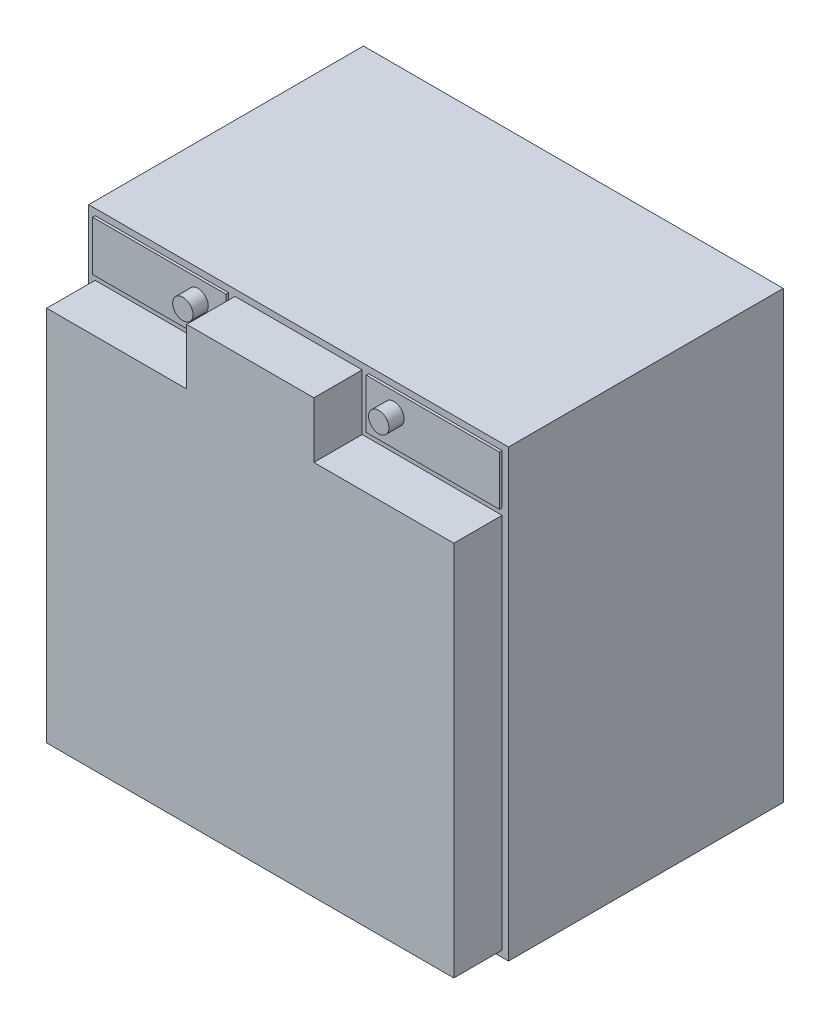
ISO-10303-21;
HEADER;
FILE_DESCRIPTION(('STEP AP214'),'2;1');
FILE_NAME('part.step','',(''),(''),'','','');
FILE_SCHEMA(('AUTOMOTIVE_DESIGN { 1 0 10303 214 1 1 1 1 }'));
ENDSEC;
DATA;
#1=APPLICATION_CONTEXT('core data for automotive mechanical design processes');
#2=APPLICATION_PROTOCOL_DEFINITION('international standard','automotive_design',2000,#1);
#3=PRODUCT_CONTEXT('',#1,'mechanical');
#4=PRODUCT('Part','Part','',(#3));
#5=PRODUCT_RELATED_PRODUCT_CATEGORY('part','',(#4));
#6=PRODUCT_DEFINITION_FORMATION('','',#4);
#7=PRODUCT_DEFINITION_CONTEXT('part definition',#1,'design');
#8=PRODUCT_DEFINITION('design','',#6,#7);
#9=PRODUCT_DEFINITION_SHAPE('','',#8);
#10=(LENGTH_UNIT() NAMED_UNIT(*) SI_UNIT(.MILLI.,.METRE.));
#11=(NAMED_UNIT(*) PLANE_ANGLE_UNIT() SI_UNIT($,.RADIAN.));
#12=(NAMED_UNIT(*) SI_UNIT($,.STERADIAN.) SOLID_ANGLE_UNIT());
#13=UNCERTAINTY_MEASURE_WITH_UNIT(LENGTH_MEASURE(1.E-05),#10,'distance_accuracy_value','');
#14=(GEOMETRIC_REPRESENTATION_CONTEXT(3) GLOBAL_UNCERTAINTY_ASSIGNED_CONTEXT((#13)) GLOBAL_UNIT_ASSIGNED_CONTEXT((#10,
#11,#12)) REPRESENTATION_CONTEXT('',''));
#15=CARTESIAN_POINT('',(0.,0.,0.));
#16=DIRECTION('',(0.,0.,1.));
#17=DIRECTION('',(1.,0.,0.));
#18=AXIS2_PLACEMENT_3D('',#15,#16,#17);
#19=CARTESIAN_POINT('',(110.08,153.,1.));
#20=DIRECTION('',(0.,0.,1.));
#21=DIRECTION('',(1.,0.,0.));
#22=AXIS2_PLACEMENT_3D('',#19,#20,#21);
#23=PLANE('',#22);
#24=DIRECTION('',(0.,-1.,0.));
#25=VECTOR('',#24,1.);
#26=CARTESIAN_POINT('',(110.08,172.5,1.));
#27=LINE('',#26,#25);
#28=CARTESIAN_POINT('',(110.08,172.5,1.));
#29=VERTEX_POINT('',#28);
#30=CARTESIAN_POINT('',(110.08,153.,1.));
#31=VERTEX_POINT('',#30);
#32=EDGE_CURVE('E185',#29,#31,#27,.T.);
#33=ORIENTED_EDGE('',*,*,#32,.T.);
#34=DIRECTION('',(1.,0.,0.));
#35=VECTOR('',#34,1.);
#36=CARTESIAN_POINT('',(110.08,153.,1.));
#37=LINE('',#36,#35);
#38=CARTESIAN_POINT('',(162.5,153.,1.));
#39=VERTEX_POINT('',#38);
#40=EDGE_CURVE('E658',#31,#39,#37,.T.);
#41=ORIENTED_EDGE('',*,*,#40,.T.);
#42=DIRECTION('',(0.,1.,0.));
#43=VECTOR('',#42,1.);
#44=CARTESIAN_POINT('',(162.5,172.5,1.));
#45=LINE('',#44,#43);
#46=CARTESIAN_POINT('',(162.5,172.5,1.));
#47=VERTEX_POINT('',#46);
#48=EDGE_CURVE('E193',#39,#47,#45,.T.);
#49=ORIENTED_EDGE('',*,*,#48,.T.);
#50=DIRECTION('',(-1.,0.,0.));
#51=VECTOR('',#50,1.);
#52=CARTESIAN_POINT('',(110.08,172.5,1.));
#53=LINE('',#52,#51);
#54=EDGE_CURVE('E189',#47,#29,#53,.T.);
#55=ORIENTED_EDGE('',*,*,#54,.T.);
#56=EDGE_LOOP('',(#33,#41,#49,#55));
#57=FACE_BOUND('',#56,.T.);
#58=CARTESIAN_POINT('',(121.,165.,1.));
#59=DIRECTION('',(0.,0.,1.));
#60=DIRECTION('',(1.,0.,0.));
#61=AXIS2_PLACEMENT_3D('',#58,#59,#60);
#62=CIRCLE('',#61,3.99999999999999);
#63=CARTESIAN_POINT('',(125.,165.,1.));
#64=VERTEX_POINT('',#63);
#65=EDGE_CURVE('E646',#64,#64,#62,.T.);
#66=ORIENTED_EDGE('',*,*,#65,.F.);
#67=EDGE_LOOP('',(#66));
#68=FACE_BOUND('',#67,.T.);
#69=ADVANCED_FACE('F34',(#57,#68),#23,.T.);
#70=CARTESIAN_POINT('',(2.5,153.,1.));
#71=DIRECTION('',(0.,0.,1.));
#72=DIRECTION('',(1.,0.,0.));
#73=AXIS2_PLACEMENT_3D('',#70,#71,#72);
#74=PLANE('',#73);
#75=DIRECTION('',(0.,-1.,0.));
#76=VECTOR('',#75,1.);
#77=CARTESIAN_POINT('',(2.5,172.5,1.));
#78=LINE('',#77,#76);
#79=CARTESIAN_POINT('',(2.5,172.5,1.));
#80=VERTEX_POINT('',#79);
#81=CARTESIAN_POINT('',(2.5,153.,1.));
#82=VERTEX_POINT('',#81);
#83=EDGE_CURVE('E213',#80,#82,#78,.T.);
#84=ORIENTED_EDGE('',*,*,#83,.T.);
#85=DIRECTION('',(1.,0.,0.));
#86=VECTOR('',#85,1.);
#87=CARTESIAN_POINT('',(2.5,153.,1.));
#88=LINE('',#87,#86);
#89=CARTESIAN_POINT('',(55.,153.,1.));
#90=VERTEX_POINT('',#89);
#91=EDGE_CURVE('E216',#82,#90,#88,.T.);
#92=ORIENTED_EDGE('',*,*,#91,.T.);
#93=DIRECTION('',(0.,1.,0.));
#94=VECTOR('',#93,1.);
#95=CARTESIAN_POINT('',(55.,172.5,1.));
#96=LINE('',#95,#94);
#97=CARTESIAN_POINT('',(55.,172.5,1.));
#98=VERTEX_POINT('',#97);
#99=EDGE_CURVE('E218',#90,#98,#96,.T.);
#100=ORIENTED_EDGE('',*,*,#99,.T.);
#101=DIRECTION('',(-1.,0.,0.));
#102=VECTOR('',#101,1.);
#103=CARTESIAN_POINT('',(2.5,172.5,1.));
#104=LINE('',#103,#102);
#105=EDGE_CURVE('E220',#98,#80,#104,.T.);
#106=ORIENTED_EDGE('',*,*,#105,.T.);
#107=EDGE_LOOP('',(#84,#92,#100,#106));
#108=FACE_BOUND('',#107,.T.);
#109=CARTESIAN_POINT('',(44.,165.,1.));
#110=DIRECTION('',(0.,0.,1.));
#111=DIRECTION('',(1.,0.,0.));
#112=AXIS2_PLACEMENT_3D('',#109,#110,#111);
#113=CIRCLE('',#112,4.00000000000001);
#114=CARTESIAN_POINT('',(48.,165.,1.));
#115=VERTEX_POINT('',#114);
#116=EDGE_CURVE('E645',#115,#115,#113,.T.);
#117=ORIENTED_EDGE('',*,*,#116,.F.);
#118=EDGE_LOOP('',(#117));
#119=FACE_BOUND('',#118,.T.);
#120=ADVANCED_FACE('F345',(#108,#119),#74,.T.);
#121=CARTESIAN_POINT('',(0.,175.,0.));
#122=DIRECTION('',(0.,0.,-1.));
#123=DIRECTION('',(-1.,0.,0.));
#124=AXIS2_PLACEMENT_3D('',#121,#122,#123);
#125=PLANE('',#124);
#126=DIRECTION('',(0.,-1.,0.));
#127=VECTOR('',#126,1.);
#128=CARTESIAN_POINT('',(2.5,172.5,0.));
#129=LINE('',#128,#127);
#130=CARTESIAN_POINT('',(2.5,172.5,0.));
#131=VERTEX_POINT('',#130);
#132=CARTESIAN_POINT('',(2.5,153.,0.));
#133=VERTEX_POINT('',#132);
#134=EDGE_CURVE('E201',#131,#133,#129,.T.);
#135=ORIENTED_EDGE('',*,*,#134,.F.);
#136=DIRECTION('',(-1.,0.,0.));
#137=VECTOR('',#136,1.);
#138=CARTESIAN_POINT('',(2.5,172.5,0.));
#139=LINE('',#138,#137);
#140=CARTESIAN_POINT('',(55.,172.5,0.));
#141=VERTEX_POINT('',#140);
#142=EDGE_CURVE('E210',#141,#131,#139,.T.);
#143=ORIENTED_EDGE('',*,*,#142,.F.);
#144=DIRECTION('',(0.,1.,0.));
#145=VECTOR('',#144,1.);
#146=CARTESIAN_POINT('',(55.,172.5,0.));
#147=LINE('',#146,#145);
#148=CARTESIAN_POINT('',(55.,153.,0.));
#149=VERTEX_POINT('',#148);
#150=EDGE_CURVE('E207',#149,#141,#147,.T.);
#151=ORIENTED_EDGE('',*,*,#150,.F.);
#152=DIRECTION('',(1.,0.,0.));
#153=VECTOR('',#152,1.);
#154=CARTESIAN_POINT('',(2.5,153.,0.));
#155=LINE('',#154,#153);
#156=EDGE_CURVE('E204',#133,#149,#155,.T.);
#157=ORIENTED_EDGE('',*,*,#156,.F.);
#158=EDGE_LOOP('',(#135,#143,#151,#157));
#159=FACE_BOUND('',#158,.T.);
#160=DIRECTION('',(1.,0.,0.));
#161=VECTOR('',#160,1.);
#162=CARTESIAN_POINT('',(0.,0.,0.));
#163=LINE('',#162,#161);
#164=CARTESIAN_POINT('',(0.,0.,0.));
#165=VERTEX_POINT('',#164);
#166=CARTESIAN_POINT('',(165.,0.,0.));
#167=VERTEX_POINT('',#166);
#168=EDGE_CURVE('E302',#165,#167,#163,.T.);
#169=ORIENTED_EDGE('',*,*,#168,.T.);
#170=DIRECTION('',(0.,-1.,0.));
#171=VECTOR('',#170,1.);
#172=CARTESIAN_POINT('',(165.,175.,0.));
#173=LINE('',#172,#171);
#174=CARTESIAN_POINT('',(165.,175.,0.));
#175=VERTEX_POINT('',#174);
#176=EDGE_CURVE('E42',#175,#167,#173,.T.);
#177=ORIENTED_EDGE('',*,*,#176,.F.);
#178=DIRECTION('',(1.,0.,0.));
#179=VECTOR('',#178,1.);
#180=CARTESIAN_POINT('',(0.,175.,0.));
#181=LINE('',#180,#179);
#182=CARTESIAN_POINT('',(0.,175.,0.));
#183=VERTEX_POINT('',#182);
#184=EDGE_CURVE('E311',#183,#175,#181,.T.);
#185=ORIENTED_EDGE('',*,*,#184,.F.);
#186=DIRECTION('',(0.,-1.,0.));
#187=VECTOR('',#186,1.);
#188=CARTESIAN_POINT('',(0.,175.,0.));
#189=LINE('',#188,#187);
#190=EDGE_CURVE('E11',#183,#165,#189,.T.);
#191=ORIENTED_EDGE('',*,*,#190,.T.);
#192=EDGE_LOOP('',(#169,#177,#185,#191));
#193=FACE_BOUND('',#192,.T.);
#194=DIRECTION('',(1.,0.,0.));
#195=VECTOR('',#194,1.);
#196=CARTESIAN_POINT('',(2.50000000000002,2.5,0.));
#197=LINE('',#196,#195);
#198=CARTESIAN_POINT('',(2.50000000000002,2.5,0.));
#199=VERTEX_POINT('',#198);
#200=CARTESIAN_POINT('',(162.5,2.5,0.));
#201=VERTEX_POINT('',#200);
#202=EDGE_CURVE('E240',#199,#201,#197,.T.);
#203=ORIENTED_EDGE('',*,*,#202,.F.);
#204=DIRECTION('',(0.,-1.,0.));
#205=VECTOR('',#204,1.);
#206=CARTESIAN_POINT('',(2.5,150.5,0.));
#207=LINE('',#206,#205);
#208=CARTESIAN_POINT('',(2.5,150.5,0.));
#209=VERTEX_POINT('',#208);
#210=EDGE_CURVE('E237',#209,#199,#207,.T.);
#211=ORIENTED_EDGE('',*,*,#210,.F.);
#212=DIRECTION('',(-1.,0.,0.));
#213=VECTOR('',#212,1.);
#214=CARTESIAN_POINT('',(57.5,150.5,0.));
#215=LINE('',#214,#213);
#216=CARTESIAN_POINT('',(57.5,150.5,0.));
#217=VERTEX_POINT('',#216);
#218=EDGE_CURVE('E234',#217,#209,#215,.T.);
#219=ORIENTED_EDGE('',*,*,#218,.F.);
#220=DIRECTION('',(0.,-1.,0.));
#221=VECTOR('',#220,1.);
#222=CARTESIAN_POINT('',(57.5,172.5,0.));
#223=LINE('',#222,#221);
#224=CARTESIAN_POINT('',(57.5,172.5,0.));
#225=VERTEX_POINT('',#224);
#226=EDGE_CURVE('E255',#225,#217,#223,.T.);
#227=ORIENTED_EDGE('',*,*,#226,.F.);
#228=DIRECTION('',(-1.,0.,0.));
#229=VECTOR('',#228,1.);
#230=CARTESIAN_POINT('',(107.5,172.5,0.));
#231=LINE('',#230,#229);
#232=CARTESIAN_POINT('',(107.5,172.5,0.));
#233=VERTEX_POINT('',#232);
#234=EDGE_CURVE('E252',#233,#225,#231,.T.);
#235=ORIENTED_EDGE('',*,*,#234,.F.);
#236=DIRECTION('',(0.,1.,0.));
#237=VECTOR('',#236,1.);
#238=CARTESIAN_POINT('',(107.5,150.5,0.));
#239=LINE('',#238,#237);
#240=CARTESIAN_POINT('',(107.5,150.5,0.));
#241=VERTEX_POINT('',#240);
#242=EDGE_CURVE('E249',#241,#233,#239,.T.);
#243=ORIENTED_EDGE('',*,*,#242,.F.);
#244=DIRECTION('',(-1.,0.,0.));
#245=VECTOR('',#244,1.);
#246=CARTESIAN_POINT('',(162.5,150.5,0.));
#247=LINE('',#246,#245);
#248=CARTESIAN_POINT('',(162.5,150.5,0.));
#249=VERTEX_POINT('',#248);
#250=EDGE_CURVE('E246',#249,#241,#247,.T.);
#251=ORIENTED_EDGE('',*,*,#250,.F.);
#252=DIRECTION('',(0.,1.,0.));
#253=VECTOR('',#252,1.);
#254=CARTESIAN_POINT('',(162.5,2.5,0.));
#255=LINE('',#254,#253);
#256=EDGE_CURVE('E243',#201,#249,#255,.T.);
#257=ORIENTED_EDGE('',*,*,#256,.F.);
#258=EDGE_LOOP('',(#203,#211,#219,#227,#235,#243,#251,#257));
#259=FACE_BOUND('',#258,.T.);
#260=DIRECTION('',(1.,0.,0.));
#261=VECTOR('',#260,1.);
#262=CARTESIAN_POINT('',(110.08,153.,0.));
#263=LINE('',#262,#261);
#264=CARTESIAN_POINT('',(110.08,153.,0.));
#265=VERTEX_POINT('',#264);
#266=CARTESIAN_POINT('',(162.5,153.,0.));
#267=VERTEX_POINT('',#266);
#268=EDGE_CURVE('E49',#265,#267,#263,.T.);
#269=ORIENTED_EDGE('',*,*,#268,.F.);
#270=DIRECTION('',(0.,-1.,0.));
#271=VECTOR('',#270,1.);
#272=CARTESIAN_POINT('',(110.08,172.5,0.));
#273=LINE('',#272,#271);
#274=CARTESIAN_POINT('',(110.08,172.5,0.));
#275=VERTEX_POINT('',#274);
#276=EDGE_CURVE('E167',#275,#265,#273,.T.);
#277=ORIENTED_EDGE('',*,*,#276,.F.);
#278=DIRECTION('',(-1.,0.,0.));
#279=VECTOR('',#278,1.);
#280=CARTESIAN_POINT('',(110.08,172.5,0.));
#281=LINE('',#280,#279);
#282=CARTESIAN_POINT('',(162.5,172.5,0.));
#283=VERTEX_POINT('',#282);
#284=EDGE_CURVE('E170',#283,#275,#281,.T.);
#285=ORIENTED_EDGE('',*,*,#284,.F.);
#286=DIRECTION('',(0.,1.,0.));
#287=VECTOR('',#286,1.);
#288=CARTESIAN_POINT('',(162.5,172.5,0.));
#289=LINE('',#288,#287);
#290=EDGE_CURVE('E54',#267,#283,#289,.T.);
#291=ORIENTED_EDGE('',*,*,#290,.F.);
#292=EDGE_LOOP('',(#269,#277,#285,#291));
#293=FACE_BOUND('',#292,.T.);
#294=ADVANCED_FACE('F169',(#159,#193,#259,#293),#125,.F.);
#295=CARTESIAN_POINT('',(0.,175.,0.));
#296=DIRECTION('',(1.,0.,0.));
#297=DIRECTION('',(0.,0.,-1.));
#298=AXIS2_PLACEMENT_3D('',#295,#296,#297);
#299=PLANE('',#298);
#300=DIRECTION('',(0.,0.,1.));
#301=VECTOR('',#300,1.);
#302=CARTESIAN_POINT('',(0.,0.,0.));
#303=LINE('',#302,#301);
#304=CARTESIAN_POINT('',(0.,0.,-108.));
#305=VERTEX_POINT('',#304);
#306=EDGE_CURVE('E299',#305,#165,#303,.T.);
#307=ORIENTED_EDGE('',*,*,#306,.T.);
#308=ORIENTED_EDGE('',*,*,#190,.F.);
#309=DIRECTION('',(0.,0.,1.));
#310=VECTOR('',#309,1.);
#311=CARTESIAN_POINT('',(0.,175.,0.));
#312=LINE('',#311,#310);
#313=CARTESIAN_POINT('',(0.,175.,-108.));
#314=VERTEX_POINT('',#313);
#315=EDGE_CURVE('E308',#314,#183,#312,.T.);
#316=ORIENTED_EDGE('',*,*,#315,.F.);
#317=DIRECTION('',(0.,-1.,0.));
#318=VECTOR('',#317,1.);
#319=CARTESIAN_POINT('',(0.,175.,-108.));
#320=LINE('',#319,#318);
#321=EDGE_CURVE('E317',#314,#305,#320,.T.);
#322=ORIENTED_EDGE('',*,*,#321,.T.);
#323=EDGE_LOOP('',(#307,#308,#316,#322));
#324=FACE_BOUND('',#323,.T.);
#325=ADVANCED_FACE('F36',(#324),#299,.F.);
#326=CARTESIAN_POINT('',(165.,175.,0.));
#327=DIRECTION('',(-1.,0.,0.));
#328=DIRECTION('',(0.,0.,1.));
#329=AXIS2_PLACEMENT_3D('',#326,#327,#328);
#330=PLANE('',#329);
#331=DIRECTION('',(0.,0.,-1.));
#332=VECTOR('',#331,1.);
#333=CARTESIAN_POINT('',(165.,0.,0.));
#334=LINE('',#333,#332);
#335=CARTESIAN_POINT('',(165.,0.,-108.));
#336=VERTEX_POINT('',#335);
#337=EDGE_CURVE('E304',#167,#336,#334,.T.);
#338=ORIENTED_EDGE('',*,*,#337,.T.);
#339=DIRECTION('',(0.,-1.,0.));
#340=VECTOR('',#339,1.);
#341=CARTESIAN_POINT('',(165.,175.,-108.));
#342=LINE('',#341,#340);
#343=CARTESIAN_POINT('',(165.,175.,-108.));
#344=VERTEX_POINT('',#343);
#345=EDGE_CURVE('E320',#344,#336,#342,.T.);
#346=ORIENTED_EDGE('',*,*,#345,.F.);
#347=DIRECTION('',(0.,0.,-1.));
#348=VECTOR('',#347,1.);
#349=CARTESIAN_POINT('',(165.,175.,0.));
#350=LINE('',#349,#348);
#351=EDGE_CURVE('E313',#175,#344,#350,.T.);
#352=ORIENTED_EDGE('',*,*,#351,.F.);
#353=ORIENTED_EDGE('',*,*,#176,.T.);
#354=EDGE_LOOP('',(#338,#346,#352,#353));
#355=FACE_BOUND('',#354,.T.);
#356=ADVANCED_FACE('F327',(#355),#330,.F.);
#357=CARTESIAN_POINT('',(0.,175.,-108.));
#358=DIRECTION('',(0.,0.,1.));
#359=DIRECTION('',(1.,0.,0.));
#360=AXIS2_PLACEMENT_3D('',#357,#358,#359);
#361=PLANE('',#360);
#362=DIRECTION('',(-1.,0.,0.));
#363=VECTOR('',#362,1.);
#364=CARTESIAN_POINT('',(0.,0.,-108.));
#365=LINE('',#364,#363);
#366=EDGE_CURVE('E306',#336,#305,#365,.T.);
#367=ORIENTED_EDGE('',*,*,#366,.T.);
#368=ORIENTED_EDGE('',*,*,#321,.F.);
#369=DIRECTION('',(-1.,0.,0.));
#370=VECTOR('',#369,1.);
#371=CARTESIAN_POINT('',(0.,175.,-108.));
#372=LINE('',#371,#370);
#373=EDGE_CURVE('E315',#344,#314,#372,.T.);
#374=ORIENTED_EDGE('',*,*,#373,.F.);
#375=ORIENTED_EDGE('',*,*,#345,.T.);
#376=EDGE_LOOP('',(#367,#368,#374,#375));
#377=FACE_BOUND('',#376,.T.);
#378=ADVANCED_FACE('F336',(#377),#361,.F.);
#379=CARTESIAN_POINT('',(0.,175.,-108.));
#380=DIRECTION('',(0.,-1.,0.));
#381=DIRECTION('',(0.,0.,-1.));
#382=AXIS2_PLACEMENT_3D('',#379,#380,#381);
#383=PLANE('',#382);
#384=ORIENTED_EDGE('',*,*,#315,.T.);
#385=ORIENTED_EDGE('',*,*,#184,.T.);
#386=ORIENTED_EDGE('',*,*,#351,.T.);
#387=ORIENTED_EDGE('',*,*,#373,.T.);
#388=EDGE_LOOP('',(#384,#385,#386,#387));
#389=FACE_BOUND('',#388,.T.);
#390=ADVANCED_FACE('F342',(#389),#383,.F.);
#391=CARTESIAN_POINT('',(0.,0.,-108.));
#392=DIRECTION('',(0.,-1.,0.));
#393=DIRECTION('',(0.,0.,-1.));
#394=AXIS2_PLACEMENT_3D('',#391,#392,#393);
#395=PLANE('',#394);
#396=ORIENTED_EDGE('',*,*,#306,.F.);
#397=ORIENTED_EDGE('',*,*,#366,.F.);
#398=ORIENTED_EDGE('',*,*,#337,.F.);
#399=ORIENTED_EDGE('',*,*,#168,.F.);
#400=EDGE_LOOP('',(#396,#397,#398,#399));
#401=FACE_BOUND('',#400,.T.);
#402=ADVANCED_FACE('F333',(#401),#395,.T.);
#403=CARTESIAN_POINT('',(57.5,150.5,19.));
#404=DIRECTION('',(0.,-1.,0.));
#405=DIRECTION('',(1.,0.,0.));
#406=AXIS2_PLACEMENT_3D('',#403,#404,#405);
#407=PLANE('',#406);
#408=ORIENTED_EDGE('',*,*,#218,.T.);
#409=DIRECTION('',(0.,0.,-1.));
#410=VECTOR('',#409,1.);
#411=CARTESIAN_POINT('',(2.5,150.5,19.));
#412=LINE('',#411,#410);
#413=CARTESIAN_POINT('',(2.5,150.5,19.));
#414=VERTEX_POINT('',#413);
#415=EDGE_CURVE('E296',#414,#209,#412,.T.);
#416=ORIENTED_EDGE('',*,*,#415,.F.);
#417=DIRECTION('',(-1.,0.,0.));
#418=VECTOR('',#417,1.);
#419=CARTESIAN_POINT('',(57.5,150.5,19.));
#420=LINE('',#419,#418);
#421=CARTESIAN_POINT('',(57.5,150.5,19.));
#422=VERTEX_POINT('',#421);
#423=EDGE_CURVE('E258',#422,#414,#420,.T.);
#424=ORIENTED_EDGE('',*,*,#423,.F.);
#425=DIRECTION('',(0.,0.,-1.));
#426=VECTOR('',#425,1.);
#427=CARTESIAN_POINT('',(57.5,150.5,19.));
#428=LINE('',#427,#426);
#429=EDGE_CURVE('E275',#422,#217,#428,.T.);
#430=ORIENTED_EDGE('',*,*,#429,.T.);
#431=EDGE_LOOP('',(#408,#416,#424,#430));
#432=FACE_BOUND('',#431,.T.);
#433=ADVANCED_FACE('F363',(#432),#407,.F.);
#434=CARTESIAN_POINT('',(2.5,150.5,19.));
#435=DIRECTION('',(1.,0.,0.));
#436=DIRECTION('',(0.,1.,0.));
#437=AXIS2_PLACEMENT_3D('',#434,#435,#436);
#438=PLANE('',#437);
#439=ORIENTED_EDGE('',*,*,#210,.T.);
#440=DIRECTION('',(0.,0.,-1.));
#441=VECTOR('',#440,1.);
#442=CARTESIAN_POINT('',(2.50000000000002,2.5,19.));
#443=LINE('',#442,#441);
#444=CARTESIAN_POINT('',(2.50000000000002,2.5,19.));
#445=VERTEX_POINT('',#444);
#446=EDGE_CURVE('E293',#445,#199,#443,.T.);
#447=ORIENTED_EDGE('',*,*,#446,.F.);
#448=DIRECTION('',(0.,-1.,0.));
#449=VECTOR('',#448,1.);
#450=CARTESIAN_POINT('',(2.5,150.5,19.));
#451=LINE('',#450,#449);
#452=EDGE_CURVE('E261',#414,#445,#451,.T.);
#453=ORIENTED_EDGE('',*,*,#452,.F.);
#454=ORIENTED_EDGE('',*,*,#415,.T.);
#455=EDGE_LOOP('',(#439,#447,#453,#454));
#456=FACE_BOUND('',#455,.T.);
#457=ADVANCED_FACE('F351',(#456),#438,.F.);
#458=CARTESIAN_POINT('',(2.50000000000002,2.5,19.));
#459=DIRECTION('',(0.,1.,0.));
#460=DIRECTION('',(0.,0.,1.));
#461=AXIS2_PLACEMENT_3D('',#458,#459,#460);
#462=PLANE('',#461);
#463=ORIENTED_EDGE('',*,*,#202,.T.);
#464=DIRECTION('',(0.,0.,-1.));
#465=VECTOR('',#464,1.);
#466=CARTESIAN_POINT('',(162.5,2.5,19.));
#467=LINE('',#466,#465);
#468=CARTESIAN_POINT('',(162.5,2.5,19.));
#469=VERTEX_POINT('',#468);
#470=EDGE_CURVE('E290',#469,#201,#467,.T.);
#471=ORIENTED_EDGE('',*,*,#470,.F.);
#472=DIRECTION('',(1.,0.,0.));
#473=VECTOR('',#472,1.);
#474=CARTESIAN_POINT('',(2.50000000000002,2.5,19.));
#475=LINE('',#474,#473);
#476=EDGE_CURVE('E263',#445,#469,#475,.T.);
#477=ORIENTED_EDGE('',*,*,#476,.F.);
#478=ORIENTED_EDGE('',*,*,#446,.T.);
#479=EDGE_LOOP('',(#463,#471,#477,#478));
#480=FACE_BOUND('',#479,.T.);
#481=ADVANCED_FACE('F354',(#480),#462,.F.);
#482=CARTESIAN_POINT('',(162.5,2.5,19.));
#483=DIRECTION('',(-1.,0.,0.));
#484=DIRECTION('',(0.,0.,1.));
#485=AXIS2_PLACEMENT_3D('',#482,#483,#484);
#486=PLANE('',#485);
#487=ORIENTED_EDGE('',*,*,#256,.T.);
#488=DIRECTION('',(0.,0.,-1.));
#489=VECTOR('',#488,1.);
#490=CARTESIAN_POINT('',(162.5,150.5,19.));
#491=LINE('',#490,#489);
#492=CARTESIAN_POINT('',(162.5,150.5,19.));
#493=VERTEX_POINT('',#492);
#494=EDGE_CURVE('E287',#493,#249,#491,.T.);
#495=ORIENTED_EDGE('',*,*,#494,.F.);
#496=DIRECTION('',(0.,1.,0.));
#497=VECTOR('',#496,1.);
#498=CARTESIAN_POINT('',(162.5,2.5,19.));
#499=LINE('',#498,#497);
#500=EDGE_CURVE('E265',#469,#493,#499,.T.);
#501=ORIENTED_EDGE('',*,*,#500,.F.);
#502=ORIENTED_EDGE('',*,*,#470,.T.);
#503=EDGE_LOOP('',(#487,#495,#501,#502));
#504=FACE_BOUND('',#503,.T.);
#505=ADVANCED_FACE('F379',(#504),#486,.F.);
#506=CARTESIAN_POINT('',(162.5,150.5,19.));
#507=DIRECTION('',(0.,-1.,0.));
#508=DIRECTION('',(1.,0.,0.));
#509=AXIS2_PLACEMENT_3D('',#506,#507,#508);
#510=PLANE('',#509);
#511=ORIENTED_EDGE('',*,*,#250,.T.);
#512=DIRECTION('',(0.,0.,-1.));
#513=VECTOR('',#512,1.);
#514=CARTESIAN_POINT('',(107.5,150.5,19.));
#515=LINE('',#514,#513);
#516=CARTESIAN_POINT('',(107.5,150.5,19.));
#517=VERTEX_POINT('',#516);
#518=EDGE_CURVE('E284',#517,#241,#515,.T.);
#519=ORIENTED_EDGE('',*,*,#518,.F.);
#520=DIRECTION('',(-1.,0.,0.));
#521=VECTOR('',#520,1.);
#522=CARTESIAN_POINT('',(162.5,150.5,19.));
#523=LINE('',#522,#521);
#524=EDGE_CURVE('E267',#493,#517,#523,.T.);
#525=ORIENTED_EDGE('',*,*,#524,.F.);
#526=ORIENTED_EDGE('',*,*,#494,.T.);
#527=EDGE_LOOP('',(#511,#519,#525,#526));
#528=FACE_BOUND('',#527,.T.);
#529=ADVANCED_FACE('F377',(#528),#510,.F.);
#530=CARTESIAN_POINT('',(107.5,150.5,19.));
#531=DIRECTION('',(-1.,0.,0.));
#532=DIRECTION('',(0.,0.,1.));
#533=AXIS2_PLACEMENT_3D('',#530,#531,#532);
#534=PLANE('',#533);
#535=ORIENTED_EDGE('',*,*,#242,.T.);
#536=DIRECTION('',(0.,0.,-1.));
#537=VECTOR('',#536,1.);
#538=CARTESIAN_POINT('',(107.5,172.5,19.));
#539=LINE('',#538,#537);
#540=CARTESIAN_POINT('',(107.5,172.5,19.));
#541=VERTEX_POINT('',#540);
#542=EDGE_CURVE('E281',#541,#233,#539,.T.);
#543=ORIENTED_EDGE('',*,*,#542,.F.);
#544=DIRECTION('',(0.,1.,0.));
#545=VECTOR('',#544,1.);
#546=CARTESIAN_POINT('',(107.5,150.5,19.));
#547=LINE('',#546,#545);
#548=EDGE_CURVE('E269',#517,#541,#547,.T.);
#549=ORIENTED_EDGE('',*,*,#548,.F.);
#550=ORIENTED_EDGE('',*,*,#518,.T.);
#551=EDGE_LOOP('',(#535,#543,#549,#550));
#552=FACE_BOUND('',#551,.T.);
#553=ADVANCED_FACE('F372',(#552),#534,.F.);
#554=CARTESIAN_POINT('',(107.5,172.5,19.));
#555=DIRECTION('',(0.,-1.,0.));
#556=DIRECTION('',(0.,0.,-1.));
#557=AXIS2_PLACEMENT_3D('',#554,#555,#556);
#558=PLANE('',#557);
#559=ORIENTED_EDGE('',*,*,#234,.T.);
#560=DIRECTION('',(0.,0.,-1.));
#561=VECTOR('',#560,1.);
#562=CARTESIAN_POINT('',(57.5,172.5,19.));
#563=LINE('',#562,#561);
#564=CARTESIAN_POINT('',(57.5,172.5,19.));
#565=VERTEX_POINT('',#564);
#566=EDGE_CURVE('E278',#565,#225,#563,.T.);
#567=ORIENTED_EDGE('',*,*,#566,.F.);
#568=DIRECTION('',(-1.,0.,0.));
#569=VECTOR('',#568,1.);
#570=CARTESIAN_POINT('',(107.5,172.5,19.));
#571=LINE('',#570,#569);
#572=EDGE_CURVE('E271',#541,#565,#571,.T.);
#573=ORIENTED_EDGE('',*,*,#572,.F.);
#574=ORIENTED_EDGE('',*,*,#542,.T.);
#575=EDGE_LOOP('',(#559,#567,#573,#574));
#576=FACE_BOUND('',#575,.T.);
#577=ADVANCED_FACE('F369',(#576),#558,.F.);
#578=CARTESIAN_POINT('',(57.5,172.5,19.));
#579=DIRECTION('',(1.,0.,0.));
#580=DIRECTION('',(0.,0.,-1.));
#581=AXIS2_PLACEMENT_3D('',#578,#579,#580);
#582=PLANE('',#581);
#583=ORIENTED_EDGE('',*,*,#226,.T.);
#584=ORIENTED_EDGE('',*,*,#429,.F.);
#585=DIRECTION('',(0.,-1.,0.));
#586=VECTOR('',#585,1.);
#587=CARTESIAN_POINT('',(57.5,172.5,19.));
#588=LINE('',#587,#586);
#589=EDGE_CURVE('E273',#565,#422,#588,.T.);
#590=ORIENTED_EDGE('',*,*,#589,.F.);
#591=ORIENTED_EDGE('',*,*,#566,.T.);
#592=EDGE_LOOP('',(#583,#584,#590,#591));
#593=FACE_BOUND('',#592,.T.);
#594=ADVANCED_FACE('F365',(#593),#582,.F.);
#595=CARTESIAN_POINT('',(2.5,150.5,19.));
#596=DIRECTION('',(0.,0.,1.));
#597=DIRECTION('',(1.,0.,0.));
#598=AXIS2_PLACEMENT_3D('',#595,#596,#597);
#599=PLANE('',#598);
#600=ORIENTED_EDGE('',*,*,#423,.T.);
#601=ORIENTED_EDGE('',*,*,#452,.T.);
#602=ORIENTED_EDGE('',*,*,#476,.T.);
#603=ORIENTED_EDGE('',*,*,#500,.T.);
#604=ORIENTED_EDGE('',*,*,#524,.T.);
#605=ORIENTED_EDGE('',*,*,#548,.T.);
#606=ORIENTED_EDGE('',*,*,#572,.T.);
#607=ORIENTED_EDGE('',*,*,#589,.T.);
#608=EDGE_LOOP('',(#600,#601,#602,#603,#604,#605,#606,#607));
#609=FACE_BOUND('',#608,.T.);
#610=ADVANCED_FACE('F357',(#609),#599,.T.);
#611=CARTESIAN_POINT('',(2.5,172.5,1.));
#612=DIRECTION('',(1.,0.,0.));
#613=DIRECTION('',(0.,1.,0.));
#614=AXIS2_PLACEMENT_3D('',#611,#612,#613);
#615=PLANE('',#614);
#616=ORIENTED_EDGE('',*,*,#134,.T.);
#617=DIRECTION('',(0.,0.,-1.));
#618=VECTOR('',#617,1.);
#619=CARTESIAN_POINT('',(2.5,153.,1.));
#620=LINE('',#619,#618);
#621=EDGE_CURVE('E231',#82,#133,#620,.T.);
#622=ORIENTED_EDGE('',*,*,#621,.F.);
#623=ORIENTED_EDGE('',*,*,#83,.F.);
#624=DIRECTION('',(0.,0.,-1.));
#625=VECTOR('',#624,1.);
#626=CARTESIAN_POINT('',(2.5,172.5,1.));
#627=LINE('',#626,#625);
#628=EDGE_CURVE('E222',#80,#131,#627,.T.);
#629=ORIENTED_EDGE('',*,*,#628,.T.);
#630=EDGE_LOOP('',(#616,#622,#623,#629));
#631=FACE_BOUND('',#630,.T.);
#632=ADVANCED_FACE('F424',(#631),#615,.F.);
#633=CARTESIAN_POINT('',(2.5,153.,1.));
#634=DIRECTION('',(0.,1.,0.));
#635=DIRECTION('',(0.,0.,1.));
#636=AXIS2_PLACEMENT_3D('',#633,#634,#635);
#637=PLANE('',#636);
#638=ORIENTED_EDGE('',*,*,#156,.T.);
#639=DIRECTION('',(0.,0.,-1.));
#640=VECTOR('',#639,1.);
#641=CARTESIAN_POINT('',(55.,153.,1.));
#642=LINE('',#641,#640);
#643=EDGE_CURVE('E228',#90,#149,#642,.T.);
#644=ORIENTED_EDGE('',*,*,#643,.F.);
#645=ORIENTED_EDGE('',*,*,#91,.F.);
#646=ORIENTED_EDGE('',*,*,#621,.T.);
#647=EDGE_LOOP('',(#638,#644,#645,#646));
#648=FACE_BOUND('',#647,.T.);
#649=ADVANCED_FACE('F420',(#648),#637,.F.);
#650=CARTESIAN_POINT('',(55.,172.5,1.));
#651=DIRECTION('',(-1.,0.,0.));
#652=DIRECTION('',(0.,0.,1.));
#653=AXIS2_PLACEMENT_3D('',#650,#651,#652);
#654=PLANE('',#653);
#655=ORIENTED_EDGE('',*,*,#150,.T.);
#656=DIRECTION('',(0.,0.,-1.));
#657=VECTOR('',#656,1.);
#658=CARTESIAN_POINT('',(55.,172.5,1.));
#659=LINE('',#658,#657);
#660=EDGE_CURVE('E225',#98,#141,#659,.T.);
#661=ORIENTED_EDGE('',*,*,#660,.F.);
#662=ORIENTED_EDGE('',*,*,#99,.F.);
#663=ORIENTED_EDGE('',*,*,#643,.T.);
#664=EDGE_LOOP('',(#655,#661,#662,#663));
#665=FACE_BOUND('',#664,.T.);
#666=ADVANCED_FACE('F416',(#665),#654,.F.);
#667=CARTESIAN_POINT('',(2.5,172.5,1.));
#668=DIRECTION('',(0.,-1.,0.));
#669=DIRECTION('',(0.,0.,-1.));
#670=AXIS2_PLACEMENT_3D('',#667,#668,#669);
#671=PLANE('',#670);
#672=ORIENTED_EDGE('',*,*,#142,.T.);
#673=ORIENTED_EDGE('',*,*,#628,.F.);
#674=ORIENTED_EDGE('',*,*,#105,.F.);
#675=ORIENTED_EDGE('',*,*,#660,.T.);
#676=EDGE_LOOP('',(#672,#673,#674,#675));
#677=FACE_BOUND('',#676,.T.);
#678=ADVANCED_FACE('F412',(#677),#671,.F.);
#679=CARTESIAN_POINT('',(110.08,172.5,1.));
#680=DIRECTION('',(1.,0.,0.));
#681=DIRECTION('',(0.,0.,-1.));
#682=AXIS2_PLACEMENT_3D('',#679,#680,#681);
#683=PLANE('',#682);
#684=ORIENTED_EDGE('',*,*,#276,.T.);
#685=DIRECTION('',(0.,0.,-1.));
#686=VECTOR('',#685,1.);
#687=CARTESIAN_POINT('',(110.08,153.,1.));
#688=LINE('',#687,#686);
#689=EDGE_CURVE('E199',#31,#265,#688,.T.);
#690=ORIENTED_EDGE('',*,*,#689,.F.);
#691=ORIENTED_EDGE('',*,*,#32,.F.);
#692=DIRECTION('',(0.,0.,-1.));
#693=VECTOR('',#692,1.);
#694=CARTESIAN_POINT('',(110.08,172.5,1.));
#695=LINE('',#694,#693);
#696=EDGE_CURVE('E181',#29,#275,#695,.T.);
#697=ORIENTED_EDGE('',*,*,#696,.T.);
#698=EDGE_LOOP('',(#684,#690,#691,#697));
#699=FACE_BOUND('',#698,.T.);
#700=ADVANCED_FACE('F187',(#699),#683,.F.);
#701=CARTESIAN_POINT('',(110.08,153.,1.));
#702=DIRECTION('',(0.,1.,0.));
#703=DIRECTION('',(0.,0.,1.));
#704=AXIS2_PLACEMENT_3D('',#701,#702,#703);
#705=PLANE('',#704);
#706=ORIENTED_EDGE('',*,*,#268,.T.);
#707=DIRECTION('',(0.,0.,-1.));
#708=VECTOR('',#707,1.);
#709=CARTESIAN_POINT('',(162.5,153.,1.));
#710=LINE('',#709,#708);
#711=EDGE_CURVE('E191',#39,#267,#710,.T.);
#712=ORIENTED_EDGE('',*,*,#711,.F.);
#713=ORIENTED_EDGE('',*,*,#40,.F.);
#714=ORIENTED_EDGE('',*,*,#689,.T.);
#715=EDGE_LOOP('',(#706,#712,#713,#714));
#716=FACE_BOUND('',#715,.T.);
#717=ADVANCED_FACE('F406',(#716),#705,.F.);
#718=CARTESIAN_POINT('',(162.5,172.5,1.));
#719=DIRECTION('',(-1.,0.,0.));
#720=DIRECTION('',(0.,0.,1.));
#721=AXIS2_PLACEMENT_3D('',#718,#719,#720);
#722=PLANE('',#721);
#723=ORIENTED_EDGE('',*,*,#290,.T.);
#724=DIRECTION('',(0.,0.,-1.));
#725=VECTOR('',#724,1.);
#726=CARTESIAN_POINT('',(162.5,172.5,1.));
#727=LINE('',#726,#725);
#728=EDGE_CURVE('E184',#47,#283,#727,.T.);
#729=ORIENTED_EDGE('',*,*,#728,.F.);
#730=ORIENTED_EDGE('',*,*,#48,.F.);
#731=ORIENTED_EDGE('',*,*,#711,.T.);
#732=EDGE_LOOP('',(#723,#729,#730,#731));
#733=FACE_BOUND('',#732,.T.);
#734=ADVANCED_FACE('F403',(#733),#722,.F.);
#735=CARTESIAN_POINT('',(110.08,172.5,1.));
#736=DIRECTION('',(0.,-1.,0.));
#737=DIRECTION('',(0.,0.,-1.));
#738=AXIS2_PLACEMENT_3D('',#735,#736,#737);
#739=PLANE('',#738);
#740=ORIENTED_EDGE('',*,*,#284,.T.);
#741=ORIENTED_EDGE('',*,*,#696,.F.);
#742=ORIENTED_EDGE('',*,*,#54,.F.);
#743=ORIENTED_EDGE('',*,*,#728,.T.);
#744=EDGE_LOOP('',(#740,#741,#742,#743));
#745=FACE_BOUND('',#744,.T.);
#746=ADVANCED_FACE('F179',(#745),#739,.F.);
#747=CARTESIAN_POINT('',(44.,165.,7.));
#748=DIRECTION('',(0.,0.,-1.));
#749=DIRECTION('',(-1.,0.,0.));
#750=AXIS2_PLACEMENT_3D('',#747,#748,#749);
#751=CYLINDRICAL_SURFACE('',#750,4.00000000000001);
#752=CARTESIAN_POINT('',(44.,165.,7.));
#753=DIRECTION('',(0.,0.,1.));
#754=DIRECTION('',(1.,0.,0.));
#755=AXIS2_PLACEMENT_3D('',#752,#753,#754);
#756=CIRCLE('',#755,4.00000000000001);
#757=CARTESIAN_POINT('',(48.,165.,7.));
#758=VERTEX_POINT('',#757);
#759=EDGE_CURVE('E174',#758,#758,#756,.T.);
#760=ORIENTED_EDGE('',*,*,#759,.F.);
#761=EDGE_LOOP('',(#760));
#762=FACE_BOUND('',#761,.T.);
#763=ORIENTED_EDGE('',*,*,#116,.T.);
#764=EDGE_LOOP('',(#763));
#765=FACE_BOUND('',#764,.T.);
#766=ADVANCED_FACE('F399',(#762,#765),#751,.T.);
#767=CARTESIAN_POINT('',(44.,165.,7.));
#768=DIRECTION('',(0.,0.,1.));
#769=DIRECTION('',(1.,0.,0.));
#770=AXIS2_PLACEMENT_3D('',#767,#768,#769);
#771=PLANE('',#770);
#772=ORIENTED_EDGE('',*,*,#759,.T.);
#773=EDGE_LOOP('',(#772));
#774=FACE_BOUND('',#773,.T.);
#775=ADVANCED_FACE('F492',(#774),#771,.T.);
#776=CARTESIAN_POINT('',(121.,165.,7.));
#777=DIRECTION('',(0.,0.,-1.));
#778=DIRECTION('',(-1.,0.,0.));
#779=AXIS2_PLACEMENT_3D('',#776,#777,#778);
#780=CYLINDRICAL_SURFACE('',#779,3.99999999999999);
#781=CARTESIAN_POINT('',(121.,165.,7.));
#782=DIRECTION('',(0.,0.,1.));
#783=DIRECTION('',(1.,0.,0.));
#784=AXIS2_PLACEMENT_3D('',#781,#782,#783);
#785=CIRCLE('',#784,3.99999999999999);
#786=CARTESIAN_POINT('',(125.,165.,7.));
#787=VERTEX_POINT('',#786);
#788=EDGE_CURVE('E644',#787,#787,#785,.T.);
#789=ORIENTED_EDGE('',*,*,#788,.F.);
#790=EDGE_LOOP('',(#789));
#791=FACE_BOUND('',#790,.T.);
#792=ORIENTED_EDGE('',*,*,#65,.T.);
#793=EDGE_LOOP('',(#792));
#794=FACE_BOUND('',#793,.T.);
#795=ADVANCED_FACE('F500',(#791,#794),#780,.T.);
#796=CARTESIAN_POINT('',(121.,165.,7.));
#797=DIRECTION('',(0.,0.,1.));
#798=DIRECTION('',(1.,0.,0.));
#799=AXIS2_PLACEMENT_3D('',#796,#797,#798);
#800=PLANE('',#799);
#801=ORIENTED_EDGE('',*,*,#788,.T.);
#802=EDGE_LOOP('',(#801));
#803=FACE_BOUND('',#802,.T.);
#804=ADVANCED_FACE('F507',(#803),#800,.T.);
#805=CLOSED_SHELL('',(#69,#120,#294,#325,#356,#378,#390,#402,#433,#457,#481,#505,#529,#553,#577,
#594,#610,#632,#649,#666,#678,#700,#717,#734,#746,#766,#775,#795,#804));
#806=MANIFOLD_SOLID_BREP('B2',#805);
#807=ADVANCED_BREP_SHAPE_REPRESENTATION('',(#18,#806),#14);
#808=SHAPE_DEFINITION_REPRESENTATION(#9,#807);
ENDSEC;
END-ISO-10303-21;
